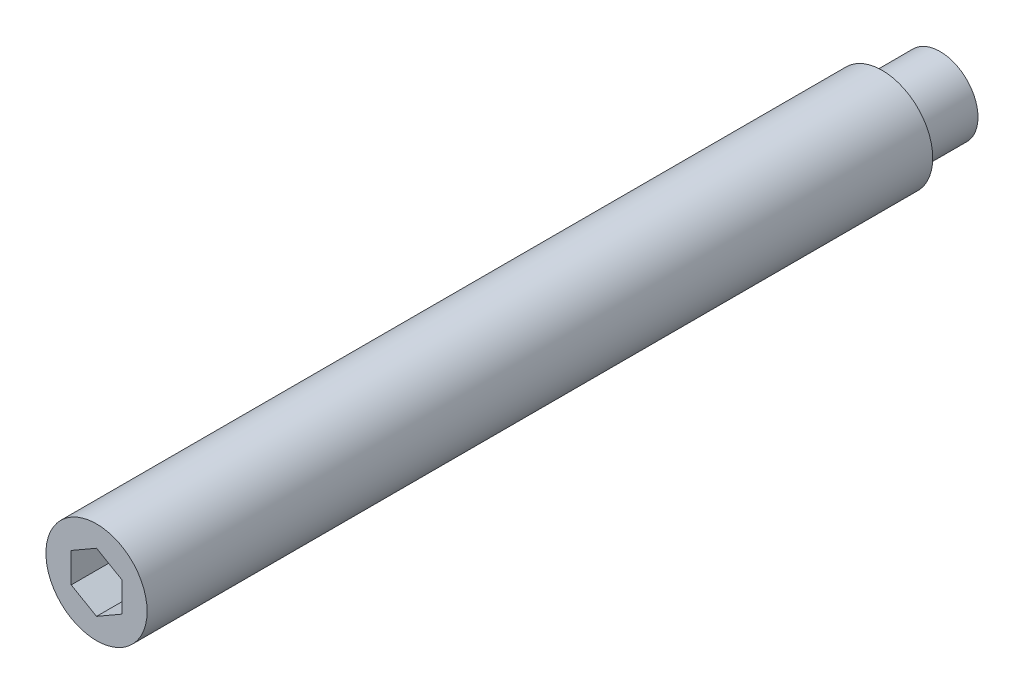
ISO-10303-21;
HEADER;
FILE_DESCRIPTION(('STEP AP214'),'2;1');
FILE_NAME('part.step','',(''),(''),'','','');
FILE_SCHEMA(('AUTOMOTIVE_DESIGN { 1 0 10303 214 1 1 1 1 }'));
ENDSEC;
DATA;
#1=APPLICATION_CONTEXT('core data for automotive mechanical design processes');
#2=APPLICATION_PROTOCOL_DEFINITION('international standard','automotive_design',2000,#1);
#3=PRODUCT_CONTEXT('',#1,'mechanical');
#4=PRODUCT('Part','Part','',(#3));
#5=PRODUCT_RELATED_PRODUCT_CATEGORY('part','',(#4));
#6=PRODUCT_DEFINITION_FORMATION('','',#4);
#7=PRODUCT_DEFINITION_CONTEXT('part definition',#1,'design');
#8=PRODUCT_DEFINITION('design','',#6,#7);
#9=PRODUCT_DEFINITION_SHAPE('','',#8);
#10=(LENGTH_UNIT() NAMED_UNIT(*) SI_UNIT(.MILLI.,.METRE.));
#11=(NAMED_UNIT(*) PLANE_ANGLE_UNIT() SI_UNIT($,.RADIAN.));
#12=(NAMED_UNIT(*) SI_UNIT($,.STERADIAN.) SOLID_ANGLE_UNIT());
#13=UNCERTAINTY_MEASURE_WITH_UNIT(LENGTH_MEASURE(1.E-05),#10,'distance_accuracy_value','');
#14=(GEOMETRIC_REPRESENTATION_CONTEXT(3) GLOBAL_UNCERTAINTY_ASSIGNED_CONTEXT((#13)) GLOBAL_UNIT_ASSIGNED_CONTEXT((#10,
#11,#12)) REPRESENTATION_CONTEXT('',''));
#15=CARTESIAN_POINT('',(0.,0.,0.));
#16=DIRECTION('',(0.,0.,1.));
#17=DIRECTION('',(1.,0.,0.));
#18=AXIS2_PLACEMENT_3D('',#15,#16,#17);
#19=CARTESIAN_POINT('',(0.,0.,110.));
#20=DIRECTION('',(0.,0.,1.));
#21=DIRECTION('',(1.,0.,0.));
#22=AXIS2_PLACEMENT_3D('',#19,#20,#21);
#23=CYLINDRICAL_SURFACE('',#22,6.);
#24=CARTESIAN_POINT('',(0.,0.,100.));
#25=DIRECTION('',(0.,0.,1.));
#26=DIRECTION('',(1.,0.,0.));
#27=AXIS2_PLACEMENT_3D('',#24,#25,#26);
#28=CIRCLE('',#27,6.);
#29=CARTESIAN_POINT('',(6.,0.,100.));
#30=VERTEX_POINT('',#29);
#31=EDGE_CURVE('E23',#30,#30,#28,.T.);
#32=ORIENTED_EDGE('',*,*,#31,.F.);
#33=EDGE_LOOP('',(#32));
#34=FACE_BOUND('',#33,.T.);
#35=CARTESIAN_POINT('',(0.,0.,6.86602540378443));
#36=DIRECTION('',(0.,0.,1.));
#37=DIRECTION('',(1.,0.,0.));
#38=AXIS2_PLACEMENT_3D('',#35,#36,#37);
#39=CIRCLE('',#38,6.);
#40=CARTESIAN_POINT('',(6.,0.,6.86602540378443));
#41=VERTEX_POINT('',#40);
#42=EDGE_CURVE('E18',#41,#41,#39,.F.);
#43=ORIENTED_EDGE('',*,*,#42,.F.);
#44=EDGE_LOOP('',(#43));
#45=FACE_BOUND('',#44,.T.);
#46=ADVANCED_FACE('F14',(#34,#45),#23,.T.);
#47=CARTESIAN_POINT('',(0.,3.5,95.));
#48=DIRECTION('',(-0.5,-0.866025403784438,0.));
#49=DIRECTION('',(0.866025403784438,-0.5,0.));
#50=AXIS2_PLACEMENT_3D('',#47,#48,#49);
#51=PLANE('',#50);
#52=DIRECTION('',(0.,0.,1.));
#53=VECTOR('',#52,1.);
#54=CARTESIAN_POINT('',(3.,1.76794919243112,95.));
#55=LINE('',#54,#53);
#56=CARTESIAN_POINT('',(3.,1.76794919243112,95.));
#57=VERTEX_POINT('',#56);
#58=CARTESIAN_POINT('',(3.,1.76794919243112,100.));
#59=VERTEX_POINT('',#58);
#60=EDGE_CURVE('E38',#57,#59,#55,.T.);
#61=ORIENTED_EDGE('',*,*,#60,.T.);
#62=DIRECTION('',(0.866025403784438,-0.5,0.));
#63=VECTOR('',#62,1.);
#64=CARTESIAN_POINT('',(0.,3.5,100.));
#65=LINE('',#64,#63);
#66=CARTESIAN_POINT('',(0.,3.5,100.));
#67=VERTEX_POINT('',#66);
#68=EDGE_CURVE('E30',#67,#59,#65,.T.);
#69=ORIENTED_EDGE('',*,*,#68,.F.);
#70=DIRECTION('',(0.,0.,1.));
#71=VECTOR('',#70,1.);
#72=CARTESIAN_POINT('',(0.,3.5,95.));
#73=LINE('',#72,#71);
#74=CARTESIAN_POINT('',(0.,3.5,95.));
#75=VERTEX_POINT('',#74);
#76=EDGE_CURVE('E94',#75,#67,#73,.T.);
#77=ORIENTED_EDGE('',*,*,#76,.F.);
#78=DIRECTION('',(0.866025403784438,-0.5,0.));
#79=VECTOR('',#78,1.);
#80=CARTESIAN_POINT('',(0.,3.5,95.));
#81=LINE('',#80,#79);
#82=EDGE_CURVE('E97',#75,#57,#81,.T.);
#83=ORIENTED_EDGE('',*,*,#82,.T.);
#84=EDGE_LOOP('',(#61,#69,#77,#83));
#85=FACE_BOUND('',#84,.T.);
#86=ADVANCED_FACE('F111',(#85),#51,.T.);
#87=CARTESIAN_POINT('',(3.,1.76794919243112,95.));
#88=DIRECTION('',(-1.,0.,0.));
#89=DIRECTION('',(0.,-1.,0.));
#90=AXIS2_PLACEMENT_3D('',#87,#88,#89);
#91=PLANE('',#90);
#92=DIRECTION('',(0.,0.,1.));
#93=VECTOR('',#92,1.);
#94=CARTESIAN_POINT('',(3.,-1.76794919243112,95.));
#95=LINE('',#94,#93);
#96=CARTESIAN_POINT('',(3.,-1.76794919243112,95.));
#97=VERTEX_POINT('',#96);
#98=CARTESIAN_POINT('',(3.,-1.76794919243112,100.));
#99=VERTEX_POINT('',#98);
#100=EDGE_CURVE('E73',#97,#99,#95,.T.);
#101=ORIENTED_EDGE('',*,*,#100,.T.);
#102=DIRECTION('',(0.,-1.,0.));
#103=VECTOR('',#102,1.);
#104=CARTESIAN_POINT('',(3.,1.76794919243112,100.));
#105=LINE('',#104,#103);
#106=EDGE_CURVE('E127',#59,#99,#105,.T.);
#107=ORIENTED_EDGE('',*,*,#106,.F.);
#108=ORIENTED_EDGE('',*,*,#60,.F.);
#109=DIRECTION('',(0.,-1.,0.));
#110=VECTOR('',#109,1.);
#111=CARTESIAN_POINT('',(3.,1.76794919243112,95.));
#112=LINE('',#111,#110);
#113=EDGE_CURVE('E82',#57,#97,#112,.T.);
#114=ORIENTED_EDGE('',*,*,#113,.T.);
#115=EDGE_LOOP('',(#101,#107,#108,#114));
#116=FACE_BOUND('',#115,.T.);
#117=ADVANCED_FACE('F136',(#116),#91,.T.);
#118=CARTESIAN_POINT('',(0.,-3.5,95.));
#119=DIRECTION('',(0.5,-0.866025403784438,0.));
#120=DIRECTION('',(0.866025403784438,0.5,0.));
#121=AXIS2_PLACEMENT_3D('',#118,#119,#120);
#122=PLANE('',#121);
#123=DIRECTION('',(0.,0.,1.));
#124=VECTOR('',#123,1.);
#125=CARTESIAN_POINT('',(0.,-3.5,95.));
#126=LINE('',#125,#124);
#127=CARTESIAN_POINT('',(0.,-3.5,95.));
#128=VERTEX_POINT('',#127);
#129=CARTESIAN_POINT('',(0.,-3.5,100.));
#130=VERTEX_POINT('',#129);
#131=EDGE_CURVE('E60',#128,#130,#126,.T.);
#132=ORIENTED_EDGE('',*,*,#131,.T.);
#133=DIRECTION('',(0.866025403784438,0.5,0.));
#134=VECTOR('',#133,1.);
#135=CARTESIAN_POINT('',(0.,-3.5,100.));
#136=LINE('',#135,#134);
#137=EDGE_CURVE('E130',#130,#99,#136,.T.);
#138=ORIENTED_EDGE('',*,*,#137,.T.);
#139=ORIENTED_EDGE('',*,*,#100,.F.);
#140=DIRECTION('',(0.866025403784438,0.5,0.));
#141=VECTOR('',#140,1.);
#142=CARTESIAN_POINT('',(0.,-3.5,95.));
#143=LINE('',#142,#141);
#144=EDGE_CURVE('E77',#128,#97,#143,.T.);
#145=ORIENTED_EDGE('',*,*,#144,.F.);
#146=EDGE_LOOP('',(#132,#138,#139,#145));
#147=FACE_BOUND('',#146,.T.);
#148=ADVANCED_FACE('F78',(#147),#122,.F.);
#149=CARTESIAN_POINT('',(0.,-3.5,95.));
#150=DIRECTION('',(0.5,0.866025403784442,0.));
#151=DIRECTION('',(-0.866025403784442,0.5,0.));
#152=AXIS2_PLACEMENT_3D('',#149,#150,#151);
#153=PLANE('',#152);
#154=DIRECTION('',(0.,0.,1.));
#155=VECTOR('',#154,1.);
#156=CARTESIAN_POINT('',(-3.,-1.76794919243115,95.));
#157=LINE('',#156,#155);
#158=CARTESIAN_POINT('',(-3.,-1.76794919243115,95.));
#159=VERTEX_POINT('',#158);
#160=CARTESIAN_POINT('',(-3.,-1.76794919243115,100.));
#161=VERTEX_POINT('',#160);
#162=EDGE_CURVE('E74',#159,#161,#157,.T.);
#163=ORIENTED_EDGE('',*,*,#162,.T.);
#164=DIRECTION('',(-0.866025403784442,0.5,0.));
#165=VECTOR('',#164,1.);
#166=CARTESIAN_POINT('',(0.,-3.5,100.));
#167=LINE('',#166,#165);
#168=EDGE_CURVE('E69',#130,#161,#167,.T.);
#169=ORIENTED_EDGE('',*,*,#168,.F.);
#170=ORIENTED_EDGE('',*,*,#131,.F.);
#171=DIRECTION('',(-0.866025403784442,0.5,0.));
#172=VECTOR('',#171,1.);
#173=CARTESIAN_POINT('',(0.,-3.5,95.));
#174=LINE('',#173,#172);
#175=EDGE_CURVE('E65',#128,#159,#174,.T.);
#176=ORIENTED_EDGE('',*,*,#175,.T.);
#177=EDGE_LOOP('',(#163,#169,#170,#176));
#178=FACE_BOUND('',#177,.T.);
#179=ADVANCED_FACE('F63',(#178),#153,.T.);
#180=CARTESIAN_POINT('',(-3.,1.76794919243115,95.));
#181=DIRECTION('',(-1.,0.,0.));
#182=DIRECTION('',(0.,0.,1.));
#183=AXIS2_PLACEMENT_3D('',#180,#181,#182);
#184=PLANE('',#183);
#185=DIRECTION('',(0.,0.,1.));
#186=VECTOR('',#185,1.);
#187=CARTESIAN_POINT('',(-3.,1.76794919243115,95.));
#188=LINE('',#187,#186);
#189=CARTESIAN_POINT('',(-3.,1.76794919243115,95.));
#190=VERTEX_POINT('',#189);
#191=CARTESIAN_POINT('',(-3.,1.76794919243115,100.));
#192=VERTEX_POINT('',#191);
#193=EDGE_CURVE('E96',#190,#192,#188,.T.);
#194=ORIENTED_EDGE('',*,*,#193,.T.);
#195=DIRECTION('',(0.,-1.,0.));
#196=VECTOR('',#195,1.);
#197=CARTESIAN_POINT('',(-3.,1.76794919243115,100.));
#198=LINE('',#197,#196);
#199=EDGE_CURVE('E119',#192,#161,#198,.T.);
#200=ORIENTED_EDGE('',*,*,#199,.T.);
#201=ORIENTED_EDGE('',*,*,#162,.F.);
#202=DIRECTION('',(0.,-1.,0.));
#203=VECTOR('',#202,1.);
#204=CARTESIAN_POINT('',(-3.,1.76794919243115,95.));
#205=LINE('',#204,#203);
#206=EDGE_CURVE('E88',#190,#159,#205,.T.);
#207=ORIENTED_EDGE('',*,*,#206,.F.);
#208=EDGE_LOOP('',(#194,#200,#201,#207));
#209=FACE_BOUND('',#208,.T.);
#210=ADVANCED_FACE('F144',(#209),#184,.F.);
#211=CARTESIAN_POINT('',(0.,3.5,95.));
#212=DIRECTION('',(-0.499999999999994,0.866025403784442,0.));
#213=DIRECTION('',(-0.866025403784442,-0.499999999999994,0.));
#214=AXIS2_PLACEMENT_3D('',#211,#212,#213);
#215=PLANE('',#214);
#216=DIRECTION('',(-0.866025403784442,-0.499999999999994,0.));
#217=VECTOR('',#216,1.);
#218=CARTESIAN_POINT('',(0.,3.5,95.));
#219=LINE('',#218,#217);
#220=EDGE_CURVE('E90',#75,#190,#219,.T.);
#221=ORIENTED_EDGE('',*,*,#220,.F.);
#222=ORIENTED_EDGE('',*,*,#76,.T.);
#223=DIRECTION('',(-0.866025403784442,-0.499999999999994,0.));
#224=VECTOR('',#223,1.);
#225=CARTESIAN_POINT('',(0.,3.5,100.));
#226=LINE('',#225,#224);
#227=EDGE_CURVE('E116',#67,#192,#226,.T.);
#228=ORIENTED_EDGE('',*,*,#227,.T.);
#229=ORIENTED_EDGE('',*,*,#193,.F.);
#230=EDGE_LOOP('',(#221,#222,#228,#229));
#231=FACE_BOUND('',#230,.T.);
#232=ADVANCED_FACE('F139',(#231),#215,.F.);
#233=CARTESIAN_POINT('',(6.06217782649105,0.,95.));
#234=DIRECTION('',(0.,0.,1.));
#235=DIRECTION('',(1.,0.,0.));
#236=AXIS2_PLACEMENT_3D('',#233,#234,#235);
#237=PLANE('',#236);
#238=ORIENTED_EDGE('',*,*,#82,.F.);
#239=ORIENTED_EDGE('',*,*,#220,.T.);
#240=ORIENTED_EDGE('',*,*,#206,.T.);
#241=ORIENTED_EDGE('',*,*,#175,.F.);
#242=ORIENTED_EDGE('',*,*,#144,.T.);
#243=ORIENTED_EDGE('',*,*,#113,.F.);
#244=EDGE_LOOP('',(#238,#239,#240,#241,#242,#243));
#245=FACE_BOUND('',#244,.T.);
#246=ADVANCED_FACE('F85',(#245),#237,.T.);
#247=CARTESIAN_POINT('',(6.,0.,100.));
#248=DIRECTION('',(0.,0.,-1.));
#249=DIRECTION('',(-1.,0.,0.));
#250=AXIS2_PLACEMENT_3D('',#247,#248,#249);
#251=PLANE('',#250);
#252=ORIENTED_EDGE('',*,*,#31,.T.);
#253=EDGE_LOOP('',(#252));
#254=FACE_BOUND('',#253,.T.);
#255=ORIENTED_EDGE('',*,*,#68,.T.);
#256=ORIENTED_EDGE('',*,*,#106,.T.);
#257=ORIENTED_EDGE('',*,*,#137,.F.);
#258=ORIENTED_EDGE('',*,*,#168,.T.);
#259=ORIENTED_EDGE('',*,*,#199,.F.);
#260=ORIENTED_EDGE('',*,*,#227,.F.);
#261=EDGE_LOOP('',(#255,#256,#257,#258,#259,#260));
#262=FACE_BOUND('',#261,.T.);
#263=ADVANCED_FACE('F106',(#254,#262),#251,.F.);
#264=CARTESIAN_POINT('',(0.,0.,6.));
#265=DIRECTION('',(0.,0.,1.));
#266=DIRECTION('',(1.,0.,0.));
#267=AXIS2_PLACEMENT_3D('',#264,#265,#266);
#268=CONICAL_SURFACE('',#267,4.5,1.0471975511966);
#269=CARTESIAN_POINT('',(0.,0.,6.));
#270=DIRECTION('',(0.,0.,-1.));
#271=DIRECTION('',(-1.,0.,0.));
#272=AXIS2_PLACEMENT_3D('',#269,#270,#271);
#273=CIRCLE('',#272,4.5);
#274=CARTESIAN_POINT('',(-4.5,0.,6.));
#275=VERTEX_POINT('',#274);
#276=EDGE_CURVE('E117',#275,#275,#273,.T.);
#277=ORIENTED_EDGE('',*,*,#276,.F.);
#278=EDGE_LOOP('',(#277));
#279=FACE_BOUND('',#278,.T.);
#280=ORIENTED_EDGE('',*,*,#42,.T.);
#281=EDGE_LOOP('',(#280));
#282=FACE_BOUND('',#281,.T.);
#283=ADVANCED_FACE('F150',(#279,#282),#268,.T.);
#284=CARTESIAN_POINT('',(0.,0.,0.));
#285=DIRECTION('',(0.,0.,1.));
#286=DIRECTION('',(1.,0.,0.));
#287=AXIS2_PLACEMENT_3D('',#284,#285,#286);
#288=PLANE('',#287);
#289=CARTESIAN_POINT('',(0.,0.,0.));
#290=DIRECTION('',(0.,0.,1.));
#291=DIRECTION('',(1.,0.,0.));
#292=AXIS2_PLACEMENT_3D('',#289,#290,#291);
#293=CIRCLE('',#292,4.5);
#294=CARTESIAN_POINT('',(4.5,0.,0.));
#295=VERTEX_POINT('',#294);
#296=EDGE_CURVE('E9',#295,#295,#293,.T.);
#297=ORIENTED_EDGE('',*,*,#296,.F.);
#298=EDGE_LOOP('',(#297));
#299=FACE_BOUND('',#298,.T.);
#300=ADVANCED_FACE('F16',(#299),#288,.F.);
#301=CARTESIAN_POINT('',(0.,0.,110.));
#302=DIRECTION('',(0.,0.,1.));
#303=DIRECTION('',(1.,0.,0.));
#304=AXIS2_PLACEMENT_3D('',#301,#302,#303);
#305=CYLINDRICAL_SURFACE('',#304,4.5);
#306=ORIENTED_EDGE('',*,*,#276,.T.);
#307=EDGE_LOOP('',(#306));
#308=FACE_BOUND('',#307,.T.);
#309=ORIENTED_EDGE('',*,*,#296,.T.);
#310=EDGE_LOOP('',(#309));
#311=FACE_BOUND('',#310,.T.);
#312=ADVANCED_FACE('F237',(#308,#311),#305,.T.);
#313=CLOSED_SHELL('',(#46,#86,#117,#148,#179,#210,#232,#246,#263,#283,#300,#312));
#314=MANIFOLD_SOLID_BREP('B1',#313);
#315=ADVANCED_BREP_SHAPE_REPRESENTATION('',(#18,#314),#14);
#316=SHAPE_DEFINITION_REPRESENTATION(#9,#315);
ENDSEC;
END-ISO-10303-21;
